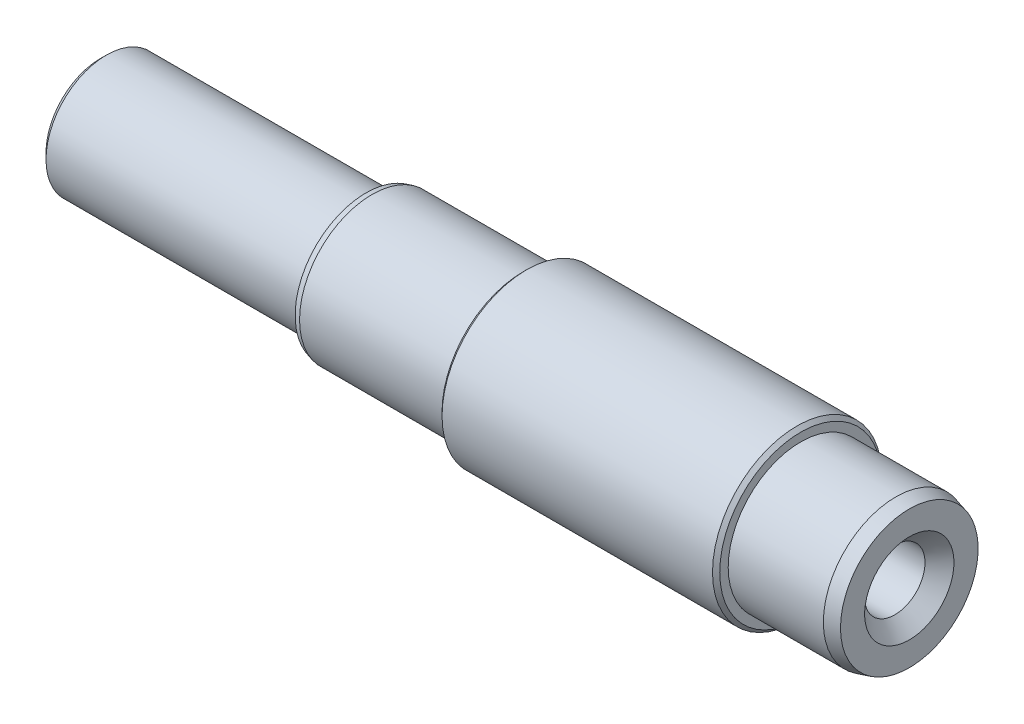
ISO-10303-21;
HEADER;
FILE_DESCRIPTION(('STEP AP214'),'2;1');
FILE_NAME('part.step','',(''),(''),'','','');
FILE_SCHEMA(('AUTOMOTIVE_DESIGN { 1 0 10303 214 1 1 1 1 }'));
ENDSEC;
DATA;
#1=APPLICATION_CONTEXT('core data for automotive mechanical design processes');
#2=APPLICATION_PROTOCOL_DEFINITION('international standard','automotive_design',2000,#1);
#3=PRODUCT_CONTEXT('',#1,'mechanical');
#4=PRODUCT('Part','Part','',(#3));
#5=PRODUCT_RELATED_PRODUCT_CATEGORY('part','',(#4));
#6=PRODUCT_DEFINITION_FORMATION('','',#4);
#7=PRODUCT_DEFINITION_CONTEXT('part definition',#1,'design');
#8=PRODUCT_DEFINITION('design','',#6,#7);
#9=PRODUCT_DEFINITION_SHAPE('','',#8);
#10=(LENGTH_UNIT() NAMED_UNIT(*) SI_UNIT(.MILLI.,.METRE.));
#11=(NAMED_UNIT(*) PLANE_ANGLE_UNIT() SI_UNIT($,.RADIAN.));
#12=(NAMED_UNIT(*) SI_UNIT($,.STERADIAN.) SOLID_ANGLE_UNIT());
#13=UNCERTAINTY_MEASURE_WITH_UNIT(LENGTH_MEASURE(1.E-05),#10,'distance_accuracy_value','');
#14=(GEOMETRIC_REPRESENTATION_CONTEXT(3) GLOBAL_UNCERTAINTY_ASSIGNED_CONTEXT((#13)) GLOBAL_UNIT_ASSIGNED_CONTEXT((#10,
#11,#12)) REPRESENTATION_CONTEXT('',''));
#15=CARTESIAN_POINT('',(0.,0.,0.));
#16=DIRECTION('',(0.,0.,1.));
#17=DIRECTION('',(1.,0.,0.));
#18=AXIS2_PLACEMENT_3D('',#15,#16,#17);
#19=CARTESIAN_POINT('',(8.5,0.,0.));
#20=DIRECTION('',(-1.,0.,0.));
#21=DIRECTION('',(0.,0.,1.));
#22=AXIS2_PLACEMENT_3D('',#19,#20,#21);
#23=PLANE('',#22);
#24=CARTESIAN_POINT('',(8.49999999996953,0.,0.));
#25=DIRECTION('',(1.,0.,0.));
#26=DIRECTION('',(0.,0.,-1.));
#27=AXIS2_PLACEMENT_3D('',#24,#25,#26);
#28=CIRCLE('',#27,4.49999999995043);
#29=CARTESIAN_POINT('',(8.49999999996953,0.,-4.49999999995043));
#30=VERTEX_POINT('',#29);
#31=EDGE_CURVE('E18',#30,#30,#28,.T.);
#32=ORIENTED_EDGE('',*,*,#31,.F.);
#33=EDGE_LOOP('',(#32));
#34=FACE_BOUND('',#33,.T.);
#35=ADVANCED_FACE('F15',(#34),#23,.T.);
#36=CARTESIAN_POINT('',(60.5,0.,0.));
#37=DIRECTION('',(-1.,0.,0.));
#38=DIRECTION('',(0.,0.,1.));
#39=AXIS2_PLACEMENT_3D('',#36,#37,#38);
#40=PLANE('',#39);
#41=CARTESIAN_POINT('',(60.5,0.,0.));
#42=DIRECTION('',(-1.,0.,0.));
#43=DIRECTION('',(0.,0.,1.));
#44=AXIS2_PLACEMENT_3D('',#41,#42,#43);
#45=CIRCLE('',#44,2.5);
#46=CARTESIAN_POINT('',(60.5,0.,2.5));
#47=VERTEX_POINT('',#46);
#48=EDGE_CURVE('E58',#47,#47,#45,.F.);
#49=ORIENTED_EDGE('',*,*,#48,.T.);
#50=EDGE_LOOP('',(#49));
#51=FACE_BOUND('',#50,.T.);
#52=ADVANCED_FACE('F70',(#51),#40,.F.);
#53=CARTESIAN_POINT('',(8.99999999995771,0.,0.));
#54=DIRECTION('',(1.,0.,0.));
#55=DIRECTION('',(0.,0.,-1.));
#56=AXIS2_PLACEMENT_3D('',#53,#54,#55);
#57=CONICAL_SURFACE('',#56,4.99999999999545,0.785398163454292);
#58=ORIENTED_EDGE('',*,*,#31,.T.);
#59=EDGE_LOOP('',(#58));
#60=FACE_BOUND('',#59,.T.);
#61=CARTESIAN_POINT('',(8.99999999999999,0.,0.));
#62=DIRECTION('',(-1.,0.,0.));
#63=DIRECTION('',(0.,0.,1.));
#64=AXIS2_PLACEMENT_3D('',#61,#62,#63);
#65=CIRCLE('',#64,5.);
#66=CARTESIAN_POINT('',(8.99999999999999,0.,5.));
#67=VERTEX_POINT('',#66);
#68=EDGE_CURVE('E30',#67,#67,#65,.F.);
#69=ORIENTED_EDGE('',*,*,#68,.F.);
#70=EDGE_LOOP('',(#69));
#71=FACE_BOUND('',#70,.T.);
#72=ADVANCED_FACE('F66',(#60,#71),#57,.T.);
#73=CARTESIAN_POINT('',(78.85,0.,0.));
#74=DIRECTION('',(-1.,0.,0.));
#75=DIRECTION('',(0.,0.,1.));
#76=AXIS2_PLACEMENT_3D('',#73,#74,#75);
#77=CYLINDRICAL_SURFACE('',#76,2.5);
#78=ORIENTED_EDGE('',*,*,#48,.F.);
#79=EDGE_LOOP('',(#78));
#80=FACE_BOUND('',#79,.T.);
#81=CARTESIAN_POINT('',(74.2999999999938,0.,0.));
#82=DIRECTION('',(1.,0.,0.));
#83=DIRECTION('',(0.,1.,0.));
#84=AXIS2_PLACEMENT_3D('',#81,#82,#83);
#85=CIRCLE('',#84,2.49999999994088);
#86=CARTESIAN_POINT('',(74.2999999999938,2.49999999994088,0.));
#87=VERTEX_POINT('',#86);
#88=EDGE_CURVE('E57',#87,#87,#85,.T.);
#89=ORIENTED_EDGE('',*,*,#88,.T.);
#90=EDGE_LOOP('',(#89));
#91=FACE_BOUND('',#90,.T.);
#92=ADVANCED_FACE('F129',(#80,#91),#77,.F.);
#93=CARTESIAN_POINT('',(78.85,0.,0.));
#94=DIRECTION('',(-1.,0.,0.));
#95=DIRECTION('',(0.,0.,1.));
#96=AXIS2_PLACEMENT_3D('',#93,#94,#95);
#97=CYLINDRICAL_SURFACE('',#96,5.);
#98=ORIENTED_EDGE('',*,*,#68,.T.);
#99=EDGE_LOOP('',(#98));
#100=FACE_BOUND('',#99,.T.);
#101=CARTESIAN_POINT('',(30.5,0.,0.));
#102=DIRECTION('',(-1.,0.,0.));
#103=DIRECTION('',(0.,0.,1.));
#104=AXIS2_PLACEMENT_3D('',#101,#102,#103);
#105=CIRCLE('',#104,5.);
#106=CARTESIAN_POINT('',(30.5,0.,5.));
#107=VERTEX_POINT('',#106);
#108=EDGE_CURVE('E55',#107,#107,#105,.F.);
#109=ORIENTED_EDGE('',*,*,#108,.F.);
#110=EDGE_LOOP('',(#109));
#111=FACE_BOUND('',#110,.T.);
#112=ADVANCED_FACE('F125',(#100,#111),#97,.T.);
#113=CARTESIAN_POINT('',(75.5000000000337,0.,0.));
#114=DIRECTION('',(1.,0.,0.));
#115=DIRECTION('',(0.,0.,-1.));
#116=AXIS2_PLACEMENT_3D('',#113,#114,#115);
#117=CONICAL_SURFACE('',#116,3.69999999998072,0.785398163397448);
#118=ORIENTED_EDGE('',*,*,#88,.F.);
#119=EDGE_LOOP('',(#118));
#120=FACE_BOUND('',#119,.T.);
#121=CARTESIAN_POINT('',(75.5000000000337,0.,0.));
#122=DIRECTION('',(1.,0.,0.));
#123=DIRECTION('',(0.,0.,-1.));
#124=AXIS2_PLACEMENT_3D('',#121,#122,#123);
#125=CIRCLE('',#124,3.69999999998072);
#126=CARTESIAN_POINT('',(75.5000000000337,0.,-3.69999999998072));
#127=VERTEX_POINT('',#126);
#128=EDGE_CURVE('E52',#127,#127,#125,.T.);
#129=ORIENTED_EDGE('',*,*,#128,.T.);
#130=EDGE_LOOP('',(#129));
#131=FACE_BOUND('',#130,.T.);
#132=ADVANCED_FACE('F121',(#120,#131),#117,.F.);
#133=CARTESIAN_POINT('',(30.5,0.,0.));
#134=DIRECTION('',(-1.,0.,0.));
#135=DIRECTION('',(0.,0.,1.));
#136=AXIS2_PLACEMENT_3D('',#133,#134,#135);
#137=PLANE('',#136);
#138=ORIENTED_EDGE('',*,*,#108,.T.);
#139=EDGE_LOOP('',(#138));
#140=FACE_BOUND('',#139,.T.);
#141=CARTESIAN_POINT('',(30.4999999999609,0.,0.));
#142=DIRECTION('',(1.,0.,0.));
#143=DIRECTION('',(0.,0.,-1.));
#144=AXIS2_PLACEMENT_3D('',#141,#142,#143);
#145=CIRCLE('',#144,5.8660254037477);
#146=CARTESIAN_POINT('',(30.4999999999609,0.,-5.8660254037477));
#147=VERTEX_POINT('',#146);
#148=EDGE_CURVE('E49',#147,#147,#145,.T.);
#149=ORIENTED_EDGE('',*,*,#148,.F.);
#150=EDGE_LOOP('',(#149));
#151=FACE_BOUND('',#150,.T.);
#152=ADVANCED_FACE('F117',(#140,#151),#137,.T.);
#153=CARTESIAN_POINT('',(75.5,0.,0.));
#154=DIRECTION('',(-1.,0.,0.));
#155=DIRECTION('',(0.,0.,1.));
#156=AXIS2_PLACEMENT_3D('',#153,#154,#155);
#157=PLANE('',#156);
#158=ORIENTED_EDGE('',*,*,#128,.F.);
#159=EDGE_LOOP('',(#158));
#160=FACE_BOUND('',#159,.T.);
#161=CARTESIAN_POINT('',(75.4999999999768,0.,0.));
#162=DIRECTION('',(-1.,0.,0.));
#163=DIRECTION('',(0.,0.,1.));
#164=AXIS2_PLACEMENT_3D('',#161,#162,#163);
#165=CIRCLE('',#164,5.70000000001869);
#166=CARTESIAN_POINT('',(75.4999999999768,0.,5.70000000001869));
#167=VERTEX_POINT('',#166);
#168=EDGE_CURVE('E45',#167,#167,#165,.T.);
#169=ORIENTED_EDGE('',*,*,#168,.F.);
#170=EDGE_LOOP('',(#169));
#171=FACE_BOUND('',#170,.T.);
#172=ADVANCED_FACE('F113',(#160,#171),#157,.F.);
#173=CARTESIAN_POINT('',(31.0000000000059,0.,0.));
#174=DIRECTION('',(1.,0.,0.));
#175=DIRECTION('',(0.,0.,-1.));
#176=AXIS2_PLACEMENT_3D('',#173,#174,#175);
#177=CONICAL_SURFACE('',#176,5.99999999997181,0.261799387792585);
#178=ORIENTED_EDGE('',*,*,#148,.T.);
#179=EDGE_LOOP('',(#178));
#180=FACE_BOUND('',#179,.T.);
#181=CARTESIAN_POINT('',(31.,0.,0.));
#182=DIRECTION('',(-1.,0.,0.));
#183=DIRECTION('',(0.,0.,1.));
#184=AXIS2_PLACEMENT_3D('',#181,#182,#183);
#185=CIRCLE('',#184,6.);
#186=CARTESIAN_POINT('',(31.,0.,6.));
#187=VERTEX_POINT('',#186);
#188=EDGE_CURVE('E48',#187,#187,#185,.F.);
#189=ORIENTED_EDGE('',*,*,#188,.F.);
#190=EDGE_LOOP('',(#189));
#191=FACE_BOUND('',#190,.T.);
#192=ADVANCED_FACE('F109',(#180,#191),#177,.T.);
#193=CARTESIAN_POINT('',(74.3803847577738,0.,0.));
#194=DIRECTION('',(-1.,0.,0.));
#195=DIRECTION('',(0.,0.,1.));
#196=AXIS2_PLACEMENT_3D('',#193,#194,#195);
#197=CONICAL_SURFACE('',#196,6.00000000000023,0.26179938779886);
#198=ORIENTED_EDGE('',*,*,#168,.T.);
#199=EDGE_LOOP('',(#198));
#200=FACE_BOUND('',#199,.T.);
#201=CARTESIAN_POINT('',(74.3803847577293,0.,0.));
#202=DIRECTION('',(-1.,0.,0.));
#203=DIRECTION('',(0.,0.,1.));
#204=AXIS2_PLACEMENT_3D('',#201,#202,#203);
#205=CIRCLE('',#204,6.);
#206=CARTESIAN_POINT('',(74.3803847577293,0.,6.));
#207=VERTEX_POINT('',#206);
#208=EDGE_CURVE('E44',#207,#207,#205,.T.);
#209=ORIENTED_EDGE('',*,*,#208,.F.);
#210=EDGE_LOOP('',(#209));
#211=FACE_BOUND('',#210,.T.);
#212=ADVANCED_FACE('F105',(#200,#211),#197,.T.);
#213=CARTESIAN_POINT('',(78.85,0.,0.));
#214=DIRECTION('',(-1.,0.,0.));
#215=DIRECTION('',(0.,0.,1.));
#216=AXIS2_PLACEMENT_3D('',#213,#214,#215);
#217=CYLINDRICAL_SURFACE('',#216,6.);
#218=ORIENTED_EDGE('',*,*,#188,.T.);
#219=EDGE_LOOP('',(#218));
#220=FACE_BOUND('',#219,.T.);
#221=CARTESIAN_POINT('',(43.5,0.,0.));
#222=DIRECTION('',(-1.,0.,0.));
#223=DIRECTION('',(0.,0.,1.));
#224=AXIS2_PLACEMENT_3D('',#221,#222,#223);
#225=CIRCLE('',#224,6.);
#226=CARTESIAN_POINT('',(43.5,0.,6.));
#227=VERTEX_POINT('',#226);
#228=EDGE_CURVE('E41',#227,#227,#225,.F.);
#229=ORIENTED_EDGE('',*,*,#228,.F.);
#230=EDGE_LOOP('',(#229));
#231=FACE_BOUND('',#230,.T.);
#232=ADVANCED_FACE('F101',(#220,#231),#217,.T.);
#233=CARTESIAN_POINT('',(78.85,0.,0.));
#234=DIRECTION('',(-1.,0.,0.));
#235=DIRECTION('',(0.,0.,1.));
#236=AXIS2_PLACEMENT_3D('',#233,#234,#235);
#237=CYLINDRICAL_SURFACE('',#236,6.);
#238=ORIENTED_EDGE('',*,*,#208,.T.);
#239=EDGE_LOOP('',(#238));
#240=FACE_BOUND('',#239,.T.);
#241=CARTESIAN_POINT('',(66.5,0.,0.));
#242=DIRECTION('',(-1.,0.,0.));
#243=DIRECTION('',(0.,0.,1.));
#244=AXIS2_PLACEMENT_3D('',#241,#242,#243);
#245=CIRCLE('',#244,6.);
#246=CARTESIAN_POINT('',(66.5,0.,6.));
#247=VERTEX_POINT('',#246);
#248=EDGE_CURVE('E38',#247,#247,#245,.F.);
#249=ORIENTED_EDGE('',*,*,#248,.T.);
#250=EDGE_LOOP('',(#249));
#251=FACE_BOUND('',#250,.T.);
#252=ADVANCED_FACE('F97',(#240,#251),#237,.T.);
#253=CARTESIAN_POINT('',(43.5,0.,0.));
#254=DIRECTION('',(-1.,0.,0.));
#255=DIRECTION('',(0.,0.,1.));
#256=AXIS2_PLACEMENT_3D('',#253,#254,#255);
#257=PLANE('',#256);
#258=ORIENTED_EDGE('',*,*,#228,.T.);
#259=EDGE_LOOP('',(#258));
#260=FACE_BOUND('',#259,.T.);
#261=CARTESIAN_POINT('',(43.5,0.,0.));
#262=DIRECTION('',(-1.,0.,0.));
#263=DIRECTION('',(0.,0.,1.));
#264=AXIS2_PLACEMENT_3D('',#261,#262,#263);
#265=CIRCLE('',#264,6.69993897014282);
#266=CARTESIAN_POINT('',(43.5,0.,6.69993897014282));
#267=VERTEX_POINT('',#266);
#268=EDGE_CURVE('E35',#267,#267,#265,.F.);
#269=ORIENTED_EDGE('',*,*,#268,.F.);
#270=EDGE_LOOP('',(#269));
#271=FACE_BOUND('',#270,.T.);
#272=ADVANCED_FACE('F93',(#260,#271),#257,.T.);
#273=CARTESIAN_POINT('',(66.5,0.,0.));
#274=DIRECTION('',(-1.,0.,0.));
#275=DIRECTION('',(0.,0.,1.));
#276=AXIS2_PLACEMENT_3D('',#273,#274,#275);
#277=PLANE('',#276);
#278=ORIENTED_EDGE('',*,*,#248,.F.);
#279=EDGE_LOOP('',(#278));
#280=FACE_BOUND('',#279,.T.);
#281=CARTESIAN_POINT('',(66.5,0.,0.));
#282=DIRECTION('',(-1.,0.,0.));
#283=DIRECTION('',(0.,0.,1.));
#284=AXIS2_PLACEMENT_3D('',#281,#282,#283);
#285=CIRCLE('',#284,6.69994353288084);
#286=CARTESIAN_POINT('',(66.5,0.,6.69994353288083));
#287=VERTEX_POINT('',#286);
#288=EDGE_CURVE('E27',#287,#287,#285,.T.);
#289=ORIENTED_EDGE('',*,*,#288,.F.);
#290=EDGE_LOOP('',(#289));
#291=FACE_BOUND('',#290,.T.);
#292=ADVANCED_FACE('F89',(#280,#291),#277,.F.);
#293=CARTESIAN_POINT('',(43.8000318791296,0.,0.));
#294=DIRECTION('',(1.,0.,0.));
#295=DIRECTION('',(0.,0.,-1.));
#296=AXIS2_PLACEMENT_3D('',#293,#294,#295);
#297=CONICAL_SURFACE('',#296,6.99996811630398,0.785393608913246);
#298=ORIENTED_EDGE('',*,*,#268,.T.);
#299=EDGE_LOOP('',(#298));
#300=FACE_BOUND('',#299,.T.);
#301=CARTESIAN_POINT('',(43.8000637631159,0.,0.));
#302=DIRECTION('',(1.,0.,0.));
#303=DIRECTION('',(0.,0.,-1.));
#304=AXIS2_PLACEMENT_3D('',#301,#302,#303);
#305=CIRCLE('',#304,6.99999999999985);
#306=CARTESIAN_POINT('',(43.8000637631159,0.,-6.99999999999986));
#307=VERTEX_POINT('',#306);
#308=EDGE_CURVE('E22',#307,#307,#305,.T.);
#309=ORIENTED_EDGE('',*,*,#308,.F.);
#310=EDGE_LOOP('',(#309));
#311=FACE_BOUND('',#310,.T.);
#312=ADVANCED_FACE('F83',(#300,#311),#297,.T.);
#313=CARTESIAN_POINT('',(66.1999705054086,0.,0.));
#314=DIRECTION('',(-1.,0.,0.));
#315=DIRECTION('',(0.,0.,1.));
#316=AXIS2_PLACEMENT_3D('',#313,#314,#315);
#317=CONICAL_SURFACE('',#316,6.99997049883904,0.785393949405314);
#318=CARTESIAN_POINT('',(66.1999410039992,0.,0.));
#319=DIRECTION('',(-1.,0.,0.));
#320=DIRECTION('',(0.,0.,1.));
#321=AXIS2_PLACEMENT_3D('',#318,#319,#320);
#322=CIRCLE('',#321,6.99999999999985);
#323=CARTESIAN_POINT('',(66.1999410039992,0.,6.99999999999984));
#324=VERTEX_POINT('',#323);
#325=EDGE_CURVE('E10',#324,#324,#322,.T.);
#326=ORIENTED_EDGE('',*,*,#325,.F.);
#327=EDGE_LOOP('',(#326));
#328=FACE_BOUND('',#327,.T.);
#329=ORIENTED_EDGE('',*,*,#288,.T.);
#330=EDGE_LOOP('',(#329));
#331=FACE_BOUND('',#330,.T.);
#332=ADVANCED_FACE('F77',(#328,#331),#317,.T.);
#333=CARTESIAN_POINT('',(78.85,0.,0.));
#334=DIRECTION('',(-1.,0.,0.));
#335=DIRECTION('',(0.,0.,1.));
#336=AXIS2_PLACEMENT_3D('',#333,#334,#335);
#337=CYLINDRICAL_SURFACE('',#336,6.99999999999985);
#338=ORIENTED_EDGE('',*,*,#308,.T.);
#339=EDGE_LOOP('',(#338));
#340=FACE_BOUND('',#339,.T.);
#341=ORIENTED_EDGE('',*,*,#325,.T.);
#342=EDGE_LOOP('',(#341));
#343=FACE_BOUND('',#342,.T.);
#344=ADVANCED_FACE('F75',(#340,#343),#337,.T.);
#345=CLOSED_SHELL('',(#35,#52,#72,#92,#112,#132,#152,#172,#192,#212,#232,#252,#272,#292,#312,
#332,#344));
#346=MANIFOLD_SOLID_BREP('B1',#345);
#347=ADVANCED_BREP_SHAPE_REPRESENTATION('',(#18,#346),#14);
#348=SHAPE_DEFINITION_REPRESENTATION(#9,#347);
ENDSEC;
END-ISO-10303-21;
